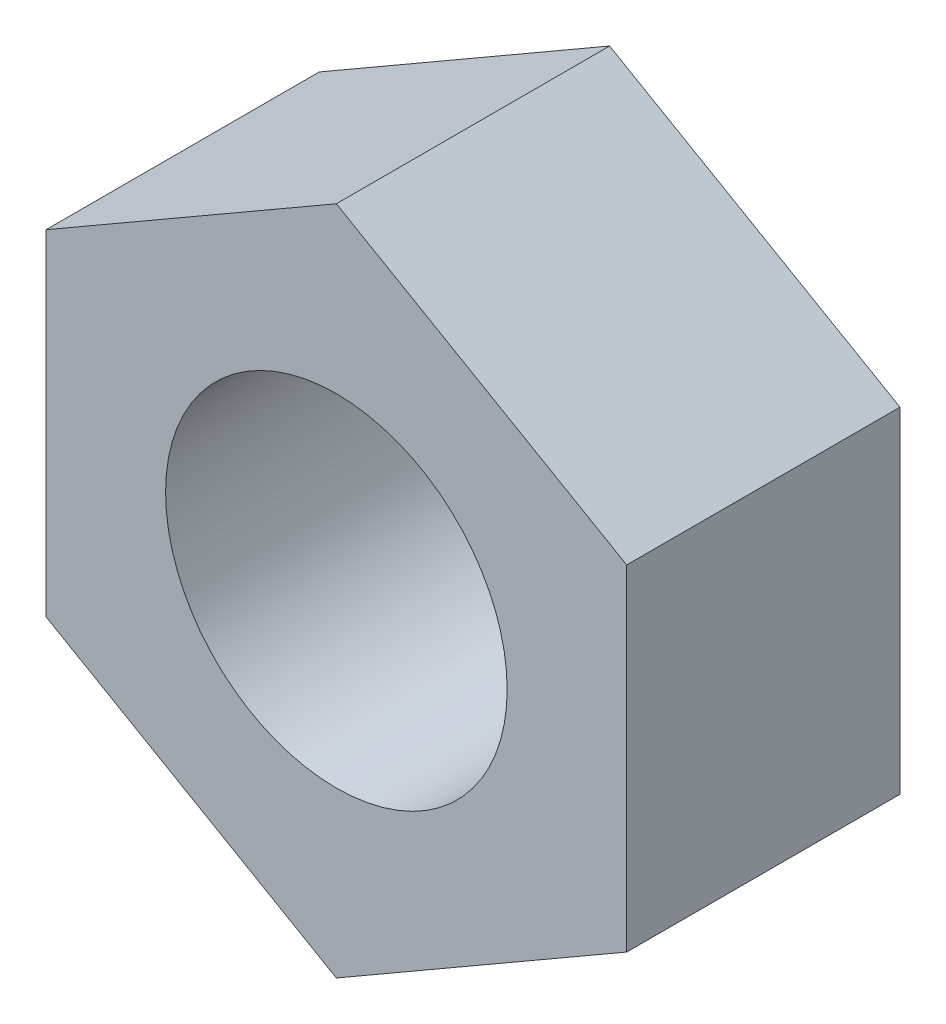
from build123d import *

# Parameters (mm, degrees)
ESQUISSE1_R        = 5
BOSS_EXTRU_1_DEPTH = 8


with BuildPart() as part:
    # Esquisse1 → Boss.-Extru.1 (new body)
    with BuildSketch(Plane.XY):
        Polygon((8.5, -4.907477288), (8.5, 4.907477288), (0, 9.814954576), (-8.5, 4.907477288), (-8.5, -4.907477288), (0, -9.814954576), align=None)
        Circle(ESQUISSE1_R, mode=Mode.SUBTRACT)
    extrude(amount=BOSS_EXTRU_1_DEPTH)


solid = part.part
